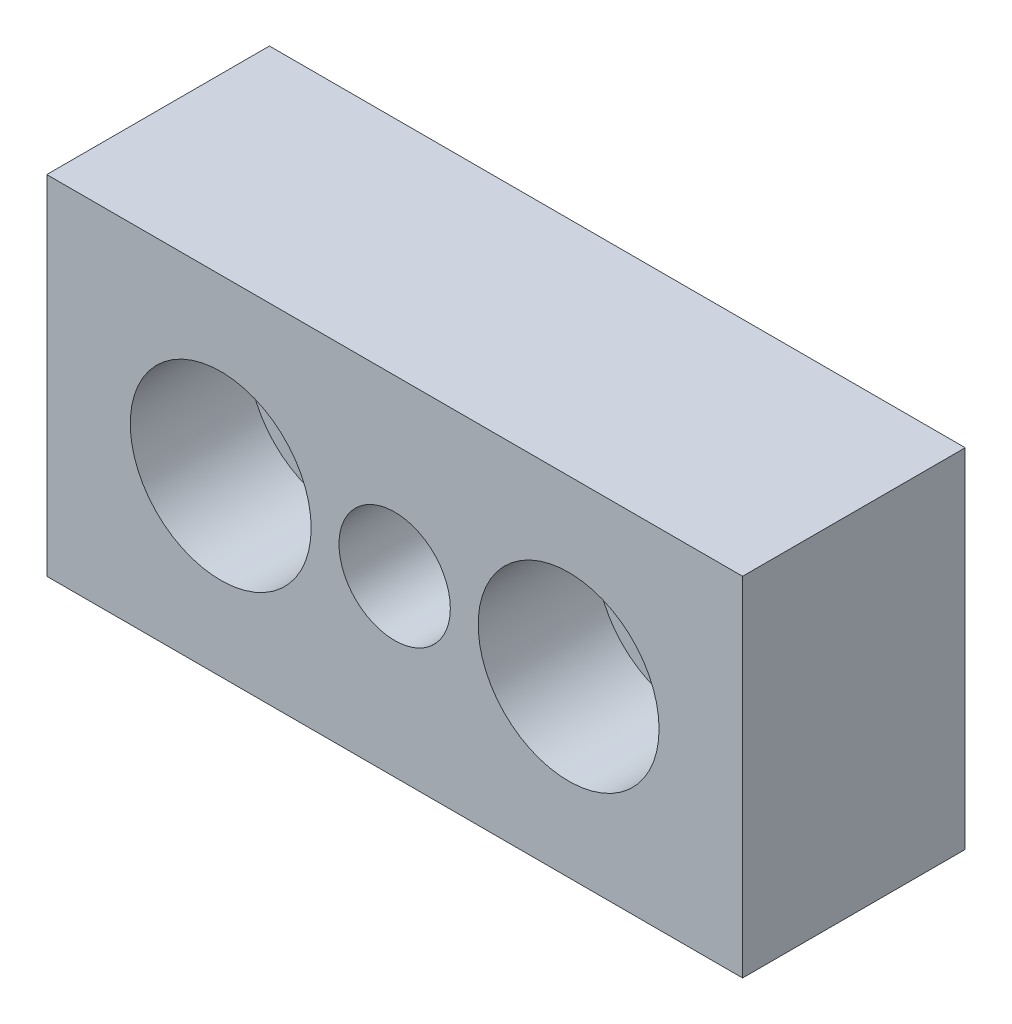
ISO-10303-21;
HEADER;
FILE_DESCRIPTION(('STEP AP214'),'2;1');
FILE_NAME('part.step','',(''),(''),'','','');
FILE_SCHEMA(('AUTOMOTIVE_DESIGN { 1 0 10303 214 1 1 1 1 }'));
ENDSEC;
DATA;
#1=APPLICATION_CONTEXT('core data for automotive mechanical design processes');
#2=APPLICATION_PROTOCOL_DEFINITION('international standard','automotive_design',2000,#1);
#3=PRODUCT_CONTEXT('',#1,'mechanical');
#4=PRODUCT('Part','Part','',(#3));
#5=PRODUCT_RELATED_PRODUCT_CATEGORY('part','',(#4));
#6=PRODUCT_DEFINITION_FORMATION('','',#4);
#7=PRODUCT_DEFINITION_CONTEXT('part definition',#1,'design');
#8=PRODUCT_DEFINITION('design','',#6,#7);
#9=PRODUCT_DEFINITION_SHAPE('','',#8);
#10=(LENGTH_UNIT() NAMED_UNIT(*) SI_UNIT(.MILLI.,.METRE.));
#11=(NAMED_UNIT(*) PLANE_ANGLE_UNIT() SI_UNIT($,.RADIAN.));
#12=(NAMED_UNIT(*) SI_UNIT($,.STERADIAN.) SOLID_ANGLE_UNIT());
#13=UNCERTAINTY_MEASURE_WITH_UNIT(LENGTH_MEASURE(1.E-05),#10,'distance_accuracy_value','');
#14=(GEOMETRIC_REPRESENTATION_CONTEXT(3) GLOBAL_UNCERTAINTY_ASSIGNED_CONTEXT((#13)) GLOBAL_UNIT_ASSIGNED_CONTEXT((#10,
#11,#12)) REPRESENTATION_CONTEXT('',''));
#15=CARTESIAN_POINT('',(0.,0.,0.));
#16=DIRECTION('',(0.,0.,1.));
#17=DIRECTION('',(1.,0.,0.));
#18=AXIS2_PLACEMENT_3D('',#15,#16,#17);
#19=CARTESIAN_POINT('',(-25.,25.,32.));
#20=DIRECTION('',(0.,0.,-1.));
#21=DIRECTION('',(-1.,0.,0.));
#22=AXIS2_PLACEMENT_3D('',#19,#20,#21);
#23=PLANE('',#22);
#24=CARTESIAN_POINT('',(0.,0.,32.));
#25=DIRECTION('',(0.,0.,1.));
#26=DIRECTION('',(1.,0.,0.));
#27=AXIS2_PLACEMENT_3D('',#24,#25,#26);
#28=CIRCLE('',#27,13.);
#29=CARTESIAN_POINT('',(13.,0.,32.));
#30=VERTEX_POINT('',#29);
#31=EDGE_CURVE('E164',#30,#30,#28,.T.);
#32=ORIENTED_EDGE('',*,*,#31,.F.);
#33=EDGE_LOOP('',(#32));
#34=FACE_BOUND('',#33,.T.);
#35=DIRECTION('',(0.,1.,0.));
#36=VECTOR('',#35,1.);
#37=CARTESIAN_POINT('',(-25.,-25.,32.));
#38=LINE('',#37,#36);
#39=CARTESIAN_POINT('',(-25.,-25.,32.));
#40=VERTEX_POINT('',#39);
#41=CARTESIAN_POINT('',(-25.,25.,32.));
#42=VERTEX_POINT('',#41);
#43=EDGE_CURVE('E66',#40,#42,#38,.T.);
#44=ORIENTED_EDGE('',*,*,#43,.F.);
#45=DIRECTION('',(-1.,0.,0.));
#46=VECTOR('',#45,1.);
#47=CARTESIAN_POINT('',(75.,-25.,32.));
#48=LINE('',#47,#46);
#49=CARTESIAN_POINT('',(75.,-25.,32.));
#50=VERTEX_POINT('',#49);
#51=EDGE_CURVE('E48',#50,#40,#48,.T.);
#52=ORIENTED_EDGE('',*,*,#51,.F.);
#53=DIRECTION('',(0.,-1.,0.));
#54=VECTOR('',#53,1.);
#55=CARTESIAN_POINT('',(75.,25.,32.));
#56=LINE('',#55,#54);
#57=CARTESIAN_POINT('',(75.,25.,32.));
#58=VERTEX_POINT('',#57);
#59=EDGE_CURVE('E57',#58,#50,#56,.T.);
#60=ORIENTED_EDGE('',*,*,#59,.F.);
#61=DIRECTION('',(1.,0.,0.));
#62=VECTOR('',#61,1.);
#63=CARTESIAN_POINT('',(-25.,25.,32.));
#64=LINE('',#63,#62);
#65=EDGE_CURVE('E62',#42,#58,#64,.T.);
#66=ORIENTED_EDGE('',*,*,#65,.F.);
#67=EDGE_LOOP('',(#44,#52,#60,#66));
#68=FACE_BOUND('',#67,.T.);
#69=CARTESIAN_POINT('',(25.,0.,32.));
#70=DIRECTION('',(0.,0.,1.));
#71=DIRECTION('',(1.,0.,0.));
#72=AXIS2_PLACEMENT_3D('',#69,#70,#71);
#73=CIRCLE('',#72,8.);
#74=CARTESIAN_POINT('',(33.,0.,32.));
#75=VERTEX_POINT('',#74);
#76=EDGE_CURVE('E84',#75,#75,#73,.T.);
#77=ORIENTED_EDGE('',*,*,#76,.F.);
#78=EDGE_LOOP('',(#77));
#79=FACE_BOUND('',#78,.T.);
#80=CARTESIAN_POINT('',(50.,0.,32.));
#81=DIRECTION('',(0.,0.,1.));
#82=DIRECTION('',(1.,0.,0.));
#83=AXIS2_PLACEMENT_3D('',#80,#81,#82);
#84=CIRCLE('',#83,13.);
#85=CARTESIAN_POINT('',(63.,0.,32.));
#86=VERTEX_POINT('',#85);
#87=EDGE_CURVE('E152',#86,#86,#84,.T.);
#88=ORIENTED_EDGE('',*,*,#87,.F.);
#89=EDGE_LOOP('',(#88));
#90=FACE_BOUND('',#89,.T.);
#91=ADVANCED_FACE('F14',(#34,#68,#79,#90),#23,.F.);
#92=CARTESIAN_POINT('',(-25.,25.,0.));
#93=DIRECTION('',(0.,0.,-1.));
#94=DIRECTION('',(-1.,0.,0.));
#95=AXIS2_PLACEMENT_3D('',#92,#93,#94);
#96=PLANE('',#95);
#97=CARTESIAN_POINT('',(0.,0.,0.));
#98=DIRECTION('',(0.,0.,1.));
#99=DIRECTION('',(1.,0.,0.));
#100=AXIS2_PLACEMENT_3D('',#97,#98,#99);
#101=CIRCLE('',#100,9.);
#102=CARTESIAN_POINT('',(9.,0.,0.));
#103=VERTEX_POINT('',#102);
#104=EDGE_CURVE('E155',#103,#103,#101,.T.);
#105=ORIENTED_EDGE('',*,*,#104,.T.);
#106=EDGE_LOOP('',(#105));
#107=FACE_BOUND('',#106,.T.);
#108=DIRECTION('',(0.,1.,0.));
#109=VECTOR('',#108,1.);
#110=CARTESIAN_POINT('',(-25.,-25.,0.));
#111=LINE('',#110,#109);
#112=CARTESIAN_POINT('',(-25.,-25.,0.));
#113=VERTEX_POINT('',#112);
#114=CARTESIAN_POINT('',(-25.,25.,0.));
#115=VERTEX_POINT('',#114);
#116=EDGE_CURVE('E67',#113,#115,#111,.T.);
#117=ORIENTED_EDGE('',*,*,#116,.T.);
#118=DIRECTION('',(1.,0.,0.));
#119=VECTOR('',#118,1.);
#120=CARTESIAN_POINT('',(-25.,25.,0.));
#121=LINE('',#120,#119);
#122=CARTESIAN_POINT('',(75.,25.,0.));
#123=VERTEX_POINT('',#122);
#124=EDGE_CURVE('E70',#115,#123,#121,.T.);
#125=ORIENTED_EDGE('',*,*,#124,.T.);
#126=DIRECTION('',(0.,-1.,0.));
#127=VECTOR('',#126,1.);
#128=CARTESIAN_POINT('',(75.,25.,0.));
#129=LINE('',#128,#127);
#130=CARTESIAN_POINT('',(75.,-25.,0.));
#131=VERTEX_POINT('',#130);
#132=EDGE_CURVE('E80',#123,#131,#129,.T.);
#133=ORIENTED_EDGE('',*,*,#132,.T.);
#134=DIRECTION('',(-1.,0.,0.));
#135=VECTOR('',#134,1.);
#136=CARTESIAN_POINT('',(75.,-25.,0.));
#137=LINE('',#136,#135);
#138=EDGE_CURVE('E51',#131,#113,#137,.T.);
#139=ORIENTED_EDGE('',*,*,#138,.T.);
#140=EDGE_LOOP('',(#117,#125,#133,#139));
#141=FACE_BOUND('',#140,.T.);
#142=CARTESIAN_POINT('',(25.,0.,0.));
#143=DIRECTION('',(0.,0.,1.));
#144=DIRECTION('',(1.,0.,0.));
#145=AXIS2_PLACEMENT_3D('',#142,#143,#144);
#146=CIRCLE('',#145,8.);
#147=CARTESIAN_POINT('',(33.,0.,0.));
#148=VERTEX_POINT('',#147);
#149=EDGE_CURVE('E167',#148,#148,#146,.T.);
#150=ORIENTED_EDGE('',*,*,#149,.T.);
#151=EDGE_LOOP('',(#150));
#152=FACE_BOUND('',#151,.T.);
#153=CARTESIAN_POINT('',(50.,0.,0.));
#154=DIRECTION('',(0.,0.,1.));
#155=DIRECTION('',(1.,0.,0.));
#156=AXIS2_PLACEMENT_3D('',#153,#154,#155);
#157=CIRCLE('',#156,9.);
#158=CARTESIAN_POINT('',(59.,0.,0.));
#159=VERTEX_POINT('',#158);
#160=EDGE_CURVE('E144',#159,#159,#157,.T.);
#161=ORIENTED_EDGE('',*,*,#160,.T.);
#162=EDGE_LOOP('',(#161));
#163=FACE_BOUND('',#162,.T.);
#164=ADVANCED_FACE('F78',(#107,#141,#152,#163),#96,.T.);
#165=CARTESIAN_POINT('',(-25.,-25.,32.));
#166=DIRECTION('',(-1.,0.,0.));
#167=DIRECTION('',(0.,0.,1.));
#168=AXIS2_PLACEMENT_3D('',#165,#166,#167);
#169=PLANE('',#168);
#170=DIRECTION('',(0.,0.,-1.));
#171=VECTOR('',#170,1.);
#172=CARTESIAN_POINT('',(-25.,-25.,32.));
#173=LINE('',#172,#171);
#174=EDGE_CURVE('E9',#40,#113,#173,.T.);
#175=ORIENTED_EDGE('',*,*,#174,.F.);
#176=ORIENTED_EDGE('',*,*,#43,.T.);
#177=DIRECTION('',(0.,0.,-1.));
#178=VECTOR('',#177,1.);
#179=CARTESIAN_POINT('',(-25.,25.,32.));
#180=LINE('',#179,#178);
#181=EDGE_CURVE('E30',#42,#115,#180,.T.);
#182=ORIENTED_EDGE('',*,*,#181,.T.);
#183=ORIENTED_EDGE('',*,*,#116,.F.);
#184=EDGE_LOOP('',(#175,#176,#182,#183));
#185=FACE_BOUND('',#184,.T.);
#186=ADVANCED_FACE('F88',(#185),#169,.T.);
#187=CARTESIAN_POINT('',(75.,-25.,32.));
#188=DIRECTION('',(0.,-1.,0.));
#189=DIRECTION('',(1.,0.,0.));
#190=AXIS2_PLACEMENT_3D('',#187,#188,#189);
#191=PLANE('',#190);
#192=DIRECTION('',(0.,0.,-1.));
#193=VECTOR('',#192,1.);
#194=CARTESIAN_POINT('',(75.,-25.,32.));
#195=LINE('',#194,#193);
#196=EDGE_CURVE('E23',#50,#131,#195,.T.);
#197=ORIENTED_EDGE('',*,*,#196,.F.);
#198=ORIENTED_EDGE('',*,*,#51,.T.);
#199=ORIENTED_EDGE('',*,*,#174,.T.);
#200=ORIENTED_EDGE('',*,*,#138,.F.);
#201=EDGE_LOOP('',(#197,#198,#199,#200));
#202=FACE_BOUND('',#201,.T.);
#203=ADVANCED_FACE('F16',(#202),#191,.T.);
#204=CARTESIAN_POINT('',(75.,25.,32.));
#205=DIRECTION('',(1.,0.,0.));
#206=DIRECTION('',(0.,1.,0.));
#207=AXIS2_PLACEMENT_3D('',#204,#205,#206);
#208=PLANE('',#207);
#209=DIRECTION('',(0.,0.,-1.));
#210=VECTOR('',#209,1.);
#211=CARTESIAN_POINT('',(75.,25.,32.));
#212=LINE('',#211,#210);
#213=EDGE_CURVE('E55',#58,#123,#212,.T.);
#214=ORIENTED_EDGE('',*,*,#213,.F.);
#215=ORIENTED_EDGE('',*,*,#59,.T.);
#216=ORIENTED_EDGE('',*,*,#196,.T.);
#217=ORIENTED_EDGE('',*,*,#132,.F.);
#218=EDGE_LOOP('',(#214,#215,#216,#217));
#219=FACE_BOUND('',#218,.T.);
#220=ADVANCED_FACE('F58',(#219),#208,.T.);
#221=CARTESIAN_POINT('',(-25.,25.,32.));
#222=DIRECTION('',(0.,1.,0.));
#223=DIRECTION('',(0.,0.,1.));
#224=AXIS2_PLACEMENT_3D('',#221,#222,#223);
#225=PLANE('',#224);
#226=ORIENTED_EDGE('',*,*,#65,.T.);
#227=ORIENTED_EDGE('',*,*,#213,.T.);
#228=ORIENTED_EDGE('',*,*,#124,.F.);
#229=ORIENTED_EDGE('',*,*,#181,.F.);
#230=EDGE_LOOP('',(#226,#227,#228,#229));
#231=FACE_BOUND('',#230,.T.);
#232=ADVANCED_FACE('F76',(#231),#225,.T.);
#233=CARTESIAN_POINT('',(25.,0.,32.));
#234=DIRECTION('',(0.,0.,-1.));
#235=DIRECTION('',(-1.,0.,0.));
#236=AXIS2_PLACEMENT_3D('',#233,#234,#235);
#237=CYLINDRICAL_SURFACE('',#236,8.);
#238=ORIENTED_EDGE('',*,*,#76,.T.);
#239=EDGE_LOOP('',(#238));
#240=FACE_BOUND('',#239,.T.);
#241=ORIENTED_EDGE('',*,*,#149,.F.);
#242=EDGE_LOOP('',(#241));
#243=FACE_BOUND('',#242,.T.);
#244=ADVANCED_FACE('F109',(#240,#243),#237,.F.);
#245=CARTESIAN_POINT('',(0.,0.,32.));
#246=DIRECTION('',(0.,0.,1.));
#247=DIRECTION('',(1.,0.,0.));
#248=AXIS2_PLACEMENT_3D('',#245,#246,#247);
#249=CYLINDRICAL_SURFACE('',#248,13.);
#250=ORIENTED_EDGE('',*,*,#31,.T.);
#251=EDGE_LOOP('',(#250));
#252=FACE_BOUND('',#251,.T.);
#253=CARTESIAN_POINT('',(0.,0.,15.));
#254=DIRECTION('',(0.,0.,1.));
#255=DIRECTION('',(1.,0.,0.));
#256=AXIS2_PLACEMENT_3D('',#253,#254,#255);
#257=CIRCLE('',#256,13.);
#258=CARTESIAN_POINT('',(13.,0.,15.));
#259=VERTEX_POINT('',#258);
#260=EDGE_CURVE('E161',#259,#259,#257,.T.);
#261=ORIENTED_EDGE('',*,*,#260,.F.);
#262=EDGE_LOOP('',(#261));
#263=FACE_BOUND('',#262,.T.);
#264=ADVANCED_FACE('F112',(#252,#263),#249,.F.);
#265=CARTESIAN_POINT('',(9.,0.,15.));
#266=DIRECTION('',(0.,0.,1.));
#267=DIRECTION('',(1.,0.,0.));
#268=AXIS2_PLACEMENT_3D('',#265,#266,#267);
#269=PLANE('',#268);
#270=ORIENTED_EDGE('',*,*,#260,.T.);
#271=EDGE_LOOP('',(#270));
#272=FACE_BOUND('',#271,.T.);
#273=CARTESIAN_POINT('',(0.,0.,15.));
#274=DIRECTION('',(0.,0.,1.));
#275=DIRECTION('',(1.,0.,0.));
#276=AXIS2_PLACEMENT_3D('',#273,#274,#275);
#277=CIRCLE('',#276,9.);
#278=CARTESIAN_POINT('',(9.,0.,15.));
#279=VERTEX_POINT('',#278);
#280=EDGE_CURVE('E158',#279,#279,#277,.T.);
#281=ORIENTED_EDGE('',*,*,#280,.F.);
#282=EDGE_LOOP('',(#281));
#283=FACE_BOUND('',#282,.T.);
#284=ADVANCED_FACE('F116',(#272,#283),#269,.T.);
#285=CARTESIAN_POINT('',(0.,0.,32.));
#286=DIRECTION('',(0.,0.,1.));
#287=DIRECTION('',(1.,0.,0.));
#288=AXIS2_PLACEMENT_3D('',#285,#286,#287);
#289=CYLINDRICAL_SURFACE('',#288,9.);
#290=ORIENTED_EDGE('',*,*,#280,.T.);
#291=EDGE_LOOP('',(#290));
#292=FACE_BOUND('',#291,.T.);
#293=ORIENTED_EDGE('',*,*,#104,.F.);
#294=EDGE_LOOP('',(#293));
#295=FACE_BOUND('',#294,.T.);
#296=ADVANCED_FACE('F120',(#292,#295),#289,.F.);
#297=CARTESIAN_POINT('',(50.,0.,32.));
#298=DIRECTION('',(0.,0.,1.));
#299=DIRECTION('',(1.,0.,0.));
#300=AXIS2_PLACEMENT_3D('',#297,#298,#299);
#301=CYLINDRICAL_SURFACE('',#300,13.);
#302=ORIENTED_EDGE('',*,*,#87,.T.);
#303=EDGE_LOOP('',(#302));
#304=FACE_BOUND('',#303,.T.);
#305=CARTESIAN_POINT('',(50.,0.,15.));
#306=DIRECTION('',(0.,0.,1.));
#307=DIRECTION('',(1.,0.,0.));
#308=AXIS2_PLACEMENT_3D('',#305,#306,#307);
#309=CIRCLE('',#308,13.);
#310=CARTESIAN_POINT('',(63.,0.,15.));
#311=VERTEX_POINT('',#310);
#312=EDGE_CURVE('E147',#311,#311,#309,.T.);
#313=ORIENTED_EDGE('',*,*,#312,.F.);
#314=EDGE_LOOP('',(#313));
#315=FACE_BOUND('',#314,.T.);
#316=ADVANCED_FACE('F124',(#304,#315),#301,.F.);
#317=CARTESIAN_POINT('',(59.,0.,15.));
#318=DIRECTION('',(0.,0.,1.));
#319=DIRECTION('',(1.,0.,0.));
#320=AXIS2_PLACEMENT_3D('',#317,#318,#319);
#321=PLANE('',#320);
#322=ORIENTED_EDGE('',*,*,#312,.T.);
#323=EDGE_LOOP('',(#322));
#324=FACE_BOUND('',#323,.T.);
#325=CARTESIAN_POINT('',(50.,0.,15.));
#326=DIRECTION('',(0.,0.,1.));
#327=DIRECTION('',(1.,0.,0.));
#328=AXIS2_PLACEMENT_3D('',#325,#326,#327);
#329=CIRCLE('',#328,9.);
#330=CARTESIAN_POINT('',(59.,0.,15.));
#331=VERTEX_POINT('',#330);
#332=EDGE_CURVE('E141',#331,#331,#329,.T.);
#333=ORIENTED_EDGE('',*,*,#332,.F.);
#334=EDGE_LOOP('',(#333));
#335=FACE_BOUND('',#334,.T.);
#336=ADVANCED_FACE('F128',(#324,#335),#321,.T.);
#337=CARTESIAN_POINT('',(50.,0.,32.));
#338=DIRECTION('',(0.,0.,1.));
#339=DIRECTION('',(1.,0.,0.));
#340=AXIS2_PLACEMENT_3D('',#337,#338,#339);
#341=CYLINDRICAL_SURFACE('',#340,9.);
#342=ORIENTED_EDGE('',*,*,#332,.T.);
#343=EDGE_LOOP('',(#342));
#344=FACE_BOUND('',#343,.T.);
#345=ORIENTED_EDGE('',*,*,#160,.F.);
#346=EDGE_LOOP('',(#345));
#347=FACE_BOUND('',#346,.T.);
#348=ADVANCED_FACE('F132',(#344,#347),#341,.F.);
#349=CLOSED_SHELL('',(#91,#164,#186,#203,#220,#232,#244,#264,#284,#296,#316,#336,#348));
#350=MANIFOLD_SOLID_BREP('B1',#349);
#351=ADVANCED_BREP_SHAPE_REPRESENTATION('',(#18,#350),#14);
#352=SHAPE_DEFINITION_REPRESENTATION(#9,#351);
ENDSEC;
END-ISO-10303-21;
